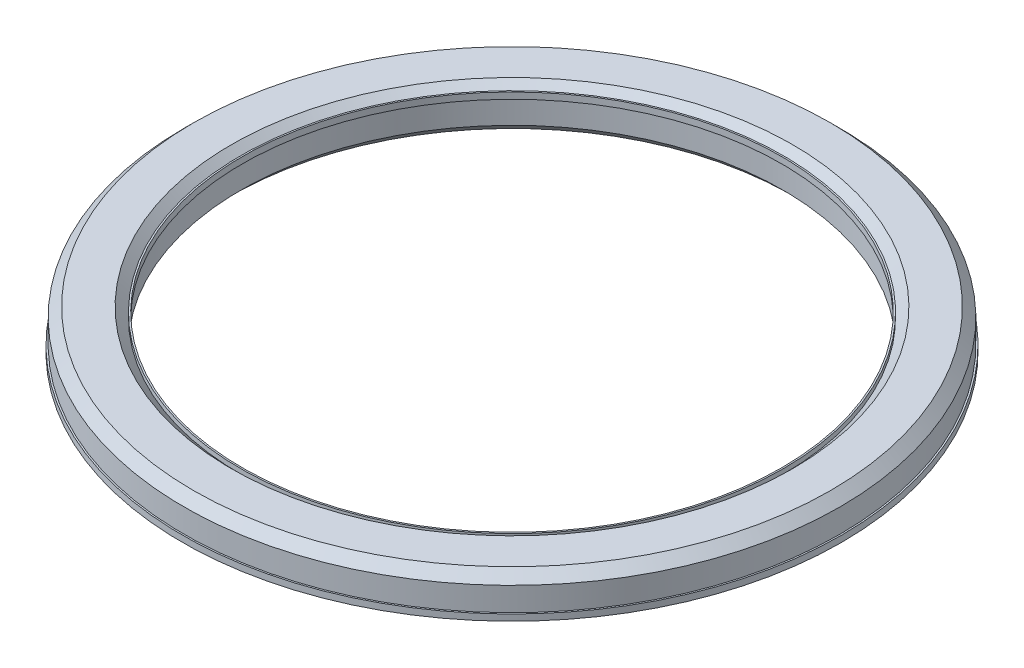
from build123d import *

# Parameters (mm, degrees)
REVOLVE1_ANGLE = 359.99999999
SKETCH2_W      = 500
SKETCH2_H      = 2000
REVOLVE2_ANGLE = 359.99999999


with BuildPart() as part:
    # Sketch1 → Revolve1 (revolve)
    with BuildSketch(Plane.XY):
        Polygon((86000, -4000), (86000, 4000), (89000, 7000), (101000, 7000), (104000, 4000), (104000, -4000), (101000, -7000), (89000, -7000), align=None)
        Polygon((86850, -3500), (86850, 3500), (89500, 6150), (100500, 6150), (103150, 3500), (103150, -3500), (100500, -6150), (89500, -6150), align=None, mode=Mode.SUBTRACT)
    revolve(axis=Axis((0, -50000, 0), (0, 1, 0)), revolution_arc=REVOLVE1_ANGLE)

    # Sketch2 → Revolve2 (revolve)
    with BuildSketch(Plane.XY):
        with Locations((85750, 4500)):
            Rectangle(SKETCH2_W, SKETCH2_H)
        with Locations((104250, -4500)):
            Rectangle(SKETCH2_W, SKETCH2_H)
    revolve(axis=Axis((0, -50000, 0), (0, 1, 0)), revolution_arc=REVOLVE2_ANGLE)


solid = part.part
